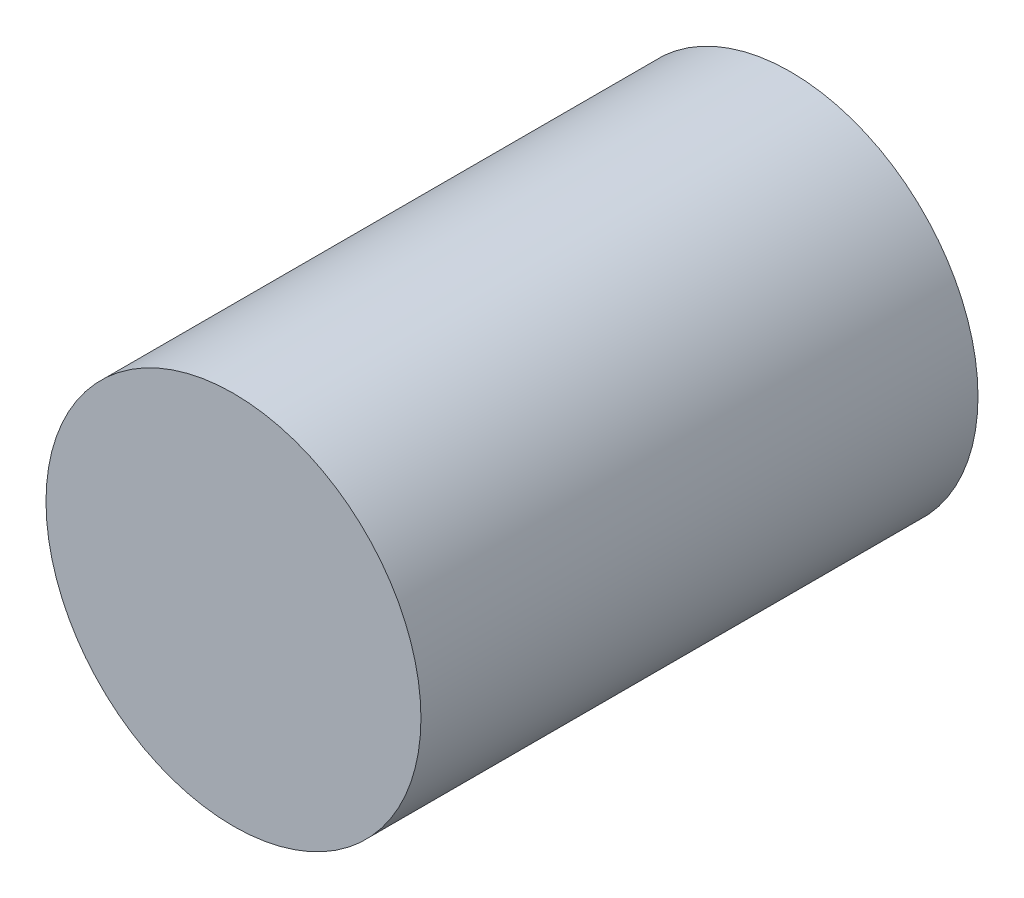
ISO-10303-21;
HEADER;
FILE_DESCRIPTION(('STEP AP214'),'2;1');
FILE_NAME('part.step','',(''),(''),'','','');
FILE_SCHEMA(('AUTOMOTIVE_DESIGN { 1 0 10303 214 1 1 1 1 }'));
ENDSEC;
DATA;
#1=APPLICATION_CONTEXT('core data for automotive mechanical design processes');
#2=APPLICATION_PROTOCOL_DEFINITION('international standard','automotive_design',2000,#1);
#3=PRODUCT_CONTEXT('',#1,'mechanical');
#4=PRODUCT('Part','Part','',(#3));
#5=PRODUCT_RELATED_PRODUCT_CATEGORY('part','',(#4));
#6=PRODUCT_DEFINITION_FORMATION('','',#4);
#7=PRODUCT_DEFINITION_CONTEXT('part definition',#1,'design');
#8=PRODUCT_DEFINITION('design','',#6,#7);
#9=PRODUCT_DEFINITION_SHAPE('','',#8);
#10=(LENGTH_UNIT() NAMED_UNIT(*) SI_UNIT(.MILLI.,.METRE.));
#11=(NAMED_UNIT(*) PLANE_ANGLE_UNIT() SI_UNIT($,.RADIAN.));
#12=(NAMED_UNIT(*) SI_UNIT($,.STERADIAN.) SOLID_ANGLE_UNIT());
#13=UNCERTAINTY_MEASURE_WITH_UNIT(LENGTH_MEASURE(1.E-05),#10,'distance_accuracy_value','');
#14=(GEOMETRIC_REPRESENTATION_CONTEXT(3) GLOBAL_UNCERTAINTY_ASSIGNED_CONTEXT((#13)) GLOBAL_UNIT_ASSIGNED_CONTEXT((#10,
#11,#12)) REPRESENTATION_CONTEXT('',''));
#15=CARTESIAN_POINT('',(0.,0.,0.));
#16=DIRECTION('',(0.,0.,1.));
#17=DIRECTION('',(1.,0.,0.));
#18=AXIS2_PLACEMENT_3D('',#15,#16,#17);
#19=CARTESIAN_POINT('',(0.,0.,0.));
#20=DIRECTION('',(0.,0.,1.));
#21=DIRECTION('',(1.,0.,0.));
#22=AXIS2_PLACEMENT_3D('',#19,#20,#21);
#23=PLANE('',#22);
#24=CARTESIAN_POINT('',(0.,5.,0.));
#25=DIRECTION('',(0.,0.,1.));
#26=DIRECTION('',(1.,0.,0.));
#27=AXIS2_PLACEMENT_3D('',#24,#25,#26);
#28=CIRCLE('',#27,1.);
#29=CARTESIAN_POINT('',(1.,5.,0.));
#30=VERTEX_POINT('',#29);
#31=EDGE_CURVE('E35',#30,#30,#28,.F.);
#32=ORIENTED_EDGE('',*,*,#31,.F.);
#33=EDGE_LOOP('',(#32));
#34=FACE_BOUND('',#33,.T.);
#35=CARTESIAN_POINT('',(0.,0.,0.));
#36=DIRECTION('',(0.,0.,1.));
#37=DIRECTION('',(1.,0.,0.));
#38=AXIS2_PLACEMENT_3D('',#35,#36,#37);
#39=CIRCLE('',#38,17.5);
#40=CARTESIAN_POINT('',(-17.5,0.,0.));
#41=VERTEX_POINT('',#40);
#42=EDGE_CURVE('E43',#41,#41,#39,.T.);
#43=ORIENTED_EDGE('',*,*,#42,.F.);
#44=EDGE_LOOP('',(#43));
#45=FACE_BOUND('',#44,.T.);
#46=CARTESIAN_POINT('',(0.,-5.,0.));
#47=DIRECTION('',(0.,0.,1.));
#48=DIRECTION('',(1.,0.,0.));
#49=AXIS2_PLACEMENT_3D('',#46,#47,#48);
#50=CIRCLE('',#49,1.);
#51=CARTESIAN_POINT('',(1.,-5.,0.));
#52=VERTEX_POINT('',#51);
#53=EDGE_CURVE('E10',#52,#52,#50,.F.);
#54=ORIENTED_EDGE('',*,*,#53,.F.);
#55=EDGE_LOOP('',(#54));
#56=FACE_BOUND('',#55,.T.);
#57=ADVANCED_FACE('F28',(#34,#45,#56),#23,.F.);
#58=CARTESIAN_POINT('',(0.,0.,52.));
#59=DIRECTION('',(0.,0.,-1.));
#60=DIRECTION('',(-1.,0.,0.));
#61=AXIS2_PLACEMENT_3D('',#58,#59,#60);
#62=CYLINDRICAL_SURFACE('',#61,17.5);
#63=CARTESIAN_POINT('',(0.,0.,52.));
#64=DIRECTION('',(0.,0.,1.));
#65=DIRECTION('',(1.,0.,0.));
#66=AXIS2_PLACEMENT_3D('',#63,#64,#65);
#67=CIRCLE('',#66,17.5);
#68=CARTESIAN_POINT('',(-17.5,0.,52.));
#69=VERTEX_POINT('',#68);
#70=EDGE_CURVE('E39',#69,#69,#67,.T.);
#71=CARTESIAN_POINT('',(-17.5,0.,52.));
#72=CARTESIAN_POINT('',(-17.5,0.,51.4583333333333));
#73=CARTESIAN_POINT('',(-17.5,0.,50.9166666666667));
#74=CARTESIAN_POINT('',(-17.5,0.,49.8333333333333));
#75=CARTESIAN_POINT('',(-17.5,0.,49.2916666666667));
#76=CARTESIAN_POINT('',(-17.5,0.,48.2083333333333));
#77=CARTESIAN_POINT('',(-17.5,0.,47.6666666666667));
#78=CARTESIAN_POINT('',(-17.5,0.,46.5833333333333));
#79=CARTESIAN_POINT('',(-17.5,0.,46.0416666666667));
#80=CARTESIAN_POINT('',(-17.5,0.,44.9583333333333));
#81=CARTESIAN_POINT('',(-17.5,0.,44.4166666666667));
#82=CARTESIAN_POINT('',(-17.5,0.,43.3333333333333));
#83=CARTESIAN_POINT('',(-17.5,0.,42.7916666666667));
#84=CARTESIAN_POINT('',(-17.5,0.,41.7083333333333));
#85=CARTESIAN_POINT('',(-17.5,0.,41.1666666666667));
#86=CARTESIAN_POINT('',(-17.5,0.,40.0833333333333));
#87=CARTESIAN_POINT('',(-17.5,0.,39.5416666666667));
#88=CARTESIAN_POINT('',(-17.5,0.,38.4583333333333));
#89=CARTESIAN_POINT('',(-17.5,0.,37.9166666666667));
#90=CARTESIAN_POINT('',(-17.5,0.,36.8333333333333));
#91=CARTESIAN_POINT('',(-17.5,0.,36.2916666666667));
#92=CARTESIAN_POINT('',(-17.5,0.,35.2083333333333));
#93=CARTESIAN_POINT('',(-17.5,0.,34.6666666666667));
#94=CARTESIAN_POINT('',(-17.5,0.,33.5833333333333));
#95=CARTESIAN_POINT('',(-17.5,0.,33.0416666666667));
#96=CARTESIAN_POINT('',(-17.5,0.,31.9583333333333));
#97=CARTESIAN_POINT('',(-17.5,0.,31.4166666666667));
#98=CARTESIAN_POINT('',(-17.5,0.,30.3333333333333));
#99=CARTESIAN_POINT('',(-17.5,0.,29.7916666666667));
#100=CARTESIAN_POINT('',(-17.5,0.,28.7083333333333));
#101=CARTESIAN_POINT('',(-17.5,0.,28.1666666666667));
#102=CARTESIAN_POINT('',(-17.5,0.,27.0833333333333));
#103=CARTESIAN_POINT('',(-17.5,0.,26.5416666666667));
#104=CARTESIAN_POINT('',(-17.5,0.,25.4583333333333));
#105=CARTESIAN_POINT('',(-17.5,0.,24.9166666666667));
#106=CARTESIAN_POINT('',(-17.5,0.,23.8333333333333));
#107=CARTESIAN_POINT('',(-17.5,0.,23.2916666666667));
#108=CARTESIAN_POINT('',(-17.5,0.,22.2083333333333));
#109=CARTESIAN_POINT('',(-17.5,0.,21.6666666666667));
#110=CARTESIAN_POINT('',(-17.5,0.,20.5833333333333));
#111=CARTESIAN_POINT('',(-17.5,0.,20.0416666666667));
#112=CARTESIAN_POINT('',(-17.5,0.,18.9583333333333));
#113=CARTESIAN_POINT('',(-17.5,0.,18.4166666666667));
#114=CARTESIAN_POINT('',(-17.5,0.,17.3333333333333));
#115=CARTESIAN_POINT('',(-17.5,0.,16.7916666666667));
#116=CARTESIAN_POINT('',(-17.5,0.,15.7083333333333));
#117=CARTESIAN_POINT('',(-17.5,0.,15.1666666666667));
#118=CARTESIAN_POINT('',(-17.5,0.,14.0833333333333));
#119=CARTESIAN_POINT('',(-17.5,0.,13.5416666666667));
#120=CARTESIAN_POINT('',(-17.5,0.,12.4583333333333));
#121=CARTESIAN_POINT('',(-17.5,0.,11.9166666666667));
#122=CARTESIAN_POINT('',(-17.5,0.,10.8333333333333));
#123=CARTESIAN_POINT('',(-17.5,0.,10.2916666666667));
#124=CARTESIAN_POINT('',(-17.5,0.,9.20833333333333));
#125=CARTESIAN_POINT('',(-17.5,0.,8.66666666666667));
#126=CARTESIAN_POINT('',(-17.5,0.,7.58333333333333));
#127=CARTESIAN_POINT('',(-17.5,0.,7.04166666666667));
#128=CARTESIAN_POINT('',(-17.5,0.,5.95833333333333));
#129=CARTESIAN_POINT('',(-17.5,0.,5.41666666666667));
#130=CARTESIAN_POINT('',(-17.5,0.,4.33333333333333));
#131=CARTESIAN_POINT('',(-17.5,0.,3.79166666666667));
#132=CARTESIAN_POINT('',(-17.5,0.,2.70833333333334));
#133=CARTESIAN_POINT('',(-17.5,0.,2.16666666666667));
#134=CARTESIAN_POINT('',(-17.5,0.,1.08333333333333));
#135=CARTESIAN_POINT('',(-17.5,0.,0.541666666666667));
#136=CARTESIAN_POINT('',(-17.5,0.,0.));
#137=B_SPLINE_CURVE_WITH_KNOTS('',3,(#71,#72,#73,#74,#75,#76,#77,#78,#79,#80,#81,#82,#83,#84,
#85,#86,#87,#88,#89,#90,#91,#92,#93,#94,#95,#96,#97,#98,#99,#100,#101,#102,#103,#104,#105,#106,
#107,#108,#109,#110,#111,#112,#113,#114,#115,#116,#117,#118,#119,#120,#121,#122,#123,#124,#125,
#126,#127,#128,#129,#130,#131,#132,#133,#134,#135,#136),.UNSPECIFIED.,.F.,.F.,(4,2,2,2,2,2,2,2,
2,2,2,2,2,2,2,2,2,2,2,2,2,2,2,2,2,2,2,2,2,2,2,2,4),(0.,1.62499999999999,3.25,4.875,
6.49999999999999,8.12499999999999,9.74999999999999,11.375,13.,14.625,16.25,17.875,19.5,21.125,
22.75,24.375,26.,27.625,29.25,30.875,32.5,34.125,35.75,37.375,39.,40.625,42.25,43.875,45.5,
47.125,48.75,50.375,52.),.UNSPECIFIED.);
#138=EDGE_CURVE('BSEAM30',#69,#41,#137,.T.);
#139=ORIENTED_EDGE('',*,*,#70,.F.);
#140=ORIENTED_EDGE('',*,*,#42,.T.);
#141=ORIENTED_EDGE('',*,*,#138,.T.);
#142=ORIENTED_EDGE('',*,*,#138,.F.);
#143=EDGE_LOOP('',(#139,#141,#140,#142));
#144=FACE_BOUND('',#143,.T.);
#145=ADVANCED_FACE('F30',(#144),#62,.T.);
#146=CARTESIAN_POINT('',(0.,0.,52.));
#147=DIRECTION('',(0.,0.,1.));
#148=DIRECTION('',(1.,0.,0.));
#149=AXIS2_PLACEMENT_3D('',#146,#147,#148);
#150=PLANE('',#149);
#151=ORIENTED_EDGE('',*,*,#70,.T.);
#152=EDGE_LOOP('',(#151));
#153=FACE_BOUND('',#152,.T.);
#154=ADVANCED_FACE('F74',(#153),#150,.T.);
#155=CARTESIAN_POINT('',(0.,5.,-6.));
#156=DIRECTION('',(0.,0.,1.));
#157=DIRECTION('',(1.,0.,0.));
#158=AXIS2_PLACEMENT_3D('',#155,#156,#157);
#159=CYLINDRICAL_SURFACE('',#158,1.);
#160=CARTESIAN_POINT('',(0.,5.,-6.));
#161=DIRECTION('',(0.,0.,-1.));
#162=DIRECTION('',(-1.,0.,0.));
#163=AXIS2_PLACEMENT_3D('',#160,#161,#162);
#164=CIRCLE('',#163,1.);
#165=CARTESIAN_POINT('',(-1.,5.,-6.));
#166=VERTEX_POINT('',#165);
#167=EDGE_CURVE('E47',#166,#166,#164,.T.);
#168=ORIENTED_EDGE('',*,*,#167,.F.);
#169=EDGE_LOOP('',(#168));
#170=FACE_BOUND('',#169,.T.);
#171=ORIENTED_EDGE('',*,*,#31,.T.);
#172=EDGE_LOOP('',(#171));
#173=FACE_BOUND('',#172,.T.);
#174=ADVANCED_FACE('F66',(#170,#173),#159,.T.);
#175=CARTESIAN_POINT('',(0.,5.,-6.));
#176=DIRECTION('',(0.,0.,-1.));
#177=DIRECTION('',(-1.,0.,0.));
#178=AXIS2_PLACEMENT_3D('',#175,#176,#177);
#179=PLANE('',#178);
#180=ORIENTED_EDGE('',*,*,#167,.T.);
#181=EDGE_LOOP('',(#180));
#182=FACE_BOUND('',#181,.T.);
#183=ADVANCED_FACE('F59',(#182),#179,.T.);
#184=CARTESIAN_POINT('',(0.,-5.,-6.));
#185=DIRECTION('',(0.,0.,1.));
#186=DIRECTION('',(1.,0.,0.));
#187=AXIS2_PLACEMENT_3D('',#184,#185,#186);
#188=CYLINDRICAL_SURFACE('',#187,1.);
#189=CARTESIAN_POINT('',(0.,-5.,-6.));
#190=DIRECTION('',(0.,0.,-1.));
#191=DIRECTION('',(-1.,0.,0.));
#192=AXIS2_PLACEMENT_3D('',#189,#190,#191);
#193=CIRCLE('',#192,1.);
#194=CARTESIAN_POINT('',(-1.,-5.,-6.));
#195=VERTEX_POINT('',#194);
#196=EDGE_CURVE('E51',#195,#195,#193,.T.);
#197=ORIENTED_EDGE('',*,*,#196,.F.);
#198=EDGE_LOOP('',(#197));
#199=FACE_BOUND('',#198,.T.);
#200=ORIENTED_EDGE('',*,*,#53,.T.);
#201=EDGE_LOOP('',(#200));
#202=FACE_BOUND('',#201,.T.);
#203=ADVANCED_FACE('F57',(#199,#202),#188,.T.);
#204=CARTESIAN_POINT('',(0.,-5.,-6.));
#205=DIRECTION('',(0.,0.,-1.));
#206=DIRECTION('',(-1.,0.,0.));
#207=AXIS2_PLACEMENT_3D('',#204,#205,#206);
#208=PLANE('',#207);
#209=ORIENTED_EDGE('',*,*,#196,.T.);
#210=EDGE_LOOP('',(#209));
#211=FACE_BOUND('',#210,.T.);
#212=ADVANCED_FACE('F55',(#211),#208,.T.);
#213=CLOSED_SHELL('',(#57,#145,#154,#174,#183,#203,#212));
#214=MANIFOLD_SOLID_BREP('B2',#213);
#215=ADVANCED_BREP_SHAPE_REPRESENTATION('',(#18,#214),#14);
#216=SHAPE_DEFINITION_REPRESENTATION(#9,#215);
ENDSEC;
END-ISO-10303-21;
